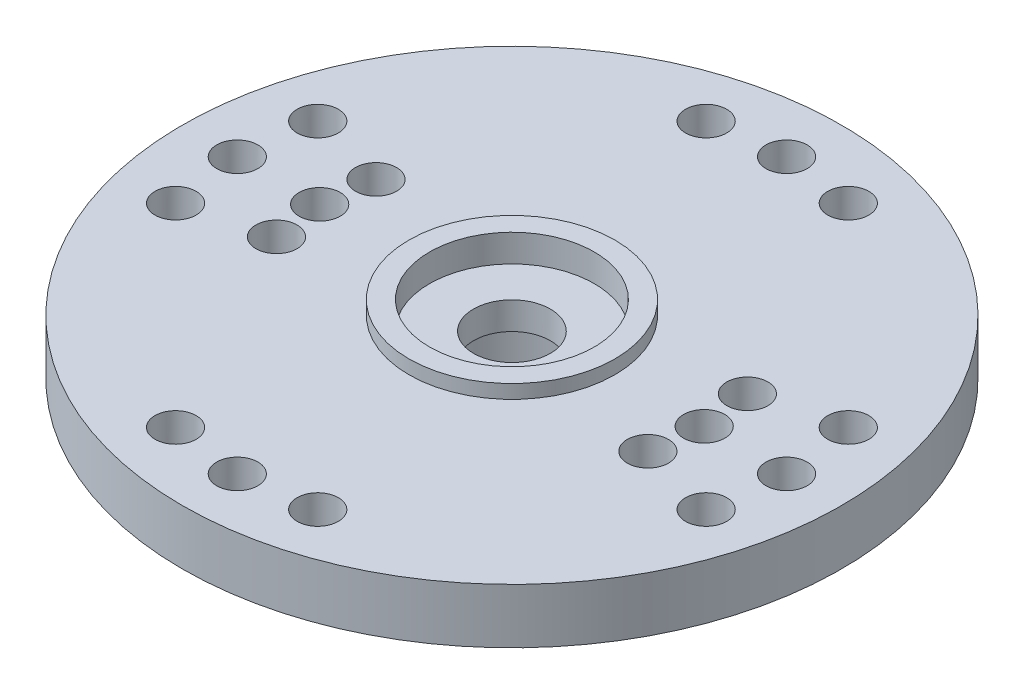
from build123d import *

# Parameters (mm, degrees)
F_1_5_1_5_DIAMETER_HOLE1_D = 1.5
CIRPATTERN1_COUNT          = 4
SKETCH4_R                  = 3
CUT_EXTRUDE1_DEPTH         = 1
CUT_EXTRUDE2_START         = -3
SKETCH5_R                  = 3
CUT_EXTRUDE2_DEPTH         = 3
F_1_5_1_5_DIAMETER_HOLE2_D = 1.5
CIRPATTERN2_COUNT          = 2


with BuildPart() as part:
    # Sketch1 → Revolve1 (revolve)
    with BuildSketch(Plane.XY, mode=Mode.PRIVATE) as revolve1_sk:
        Polygon((-12, 0), (-3.75, 0), (-3.75, 0.5), (-1.4, 0.5), (-1.4, -4.5), (-4.45, -4.5), (-4.45, -2), (-12, -2), align=None)
    revolve(revolve1_sk.sketch.rotate(Axis((0, 0, 0), (0, -1, 0)), 270), axis=Axis((0, 0, 0), (0, -1, 0)))

    # 1.5 _1.5_ Diameter Hole1 (through all)
    with Locations(Plane(origin=(0, 0, 0), x_dir=(-1, 0, 0), z_dir=(0, 1, 0))):
        with Locations((0, -10), (2.588190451, -9.659258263), (-2.588190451, -9.659258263)):
            f_1_5_1_5_diameter_hole1 = Hole(F_1_5_1_5_DIAMETER_HOLE1_D / 2)

    # CirPattern1: 1.5 _1.5_ Diameter Hole1 ×4 about axis
    cirpattern1_axis = Axis((0, 0, 0), (0, 1, 0))
    for i in range(1, CIRPATTERN1_COUNT):
        add(f_1_5_1_5_diameter_hole1.rotate(cirpattern1_axis, i * 360 / CIRPATTERN1_COUNT), mode=Mode.SUBTRACT)

    # Sketch4 → Cut-Extrude1 (cut)
    with BuildSketch(Plane(origin=(0, 0.5, 0), x_dir=(-1, 0, 0), z_dir=(0, 1, 0))):
        with Locations(Location((0, 0, 0), (0, 0, 90))):
            Circle(SKETCH4_R)
    extrude(amount=-CUT_EXTRUDE1_DEPTH, mode=Mode.SUBTRACT)

    # Sketch5 → Cut-Extrude2 (cut)
    with BuildSketch(Plane.XZ.offset(4.5).offset(CUT_EXTRUDE2_START)):
        with Locations(Location((0, 0, 0), (0, 0, 90))):
            Circle(SKETCH5_R)
    extrude(amount=CUT_EXTRUDE2_DEPTH, mode=Mode.SUBTRACT)

    # 1.5 _1.5_ Diameter Hole2 (through all)
    with Locations(Plane(origin=(0, 0, 0), x_dir=(-1, 0, 0), z_dir=(0, 1, 0))):
        with Locations((6.761480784, -1.811733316), (7, 0), (6.761480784, 1.811733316)):
            f_1_5_1_5_diameter_hole2 = Hole(F_1_5_1_5_DIAMETER_HOLE2_D / 2)

    # CirPattern2: 1.5 _1.5_ Diameter Hole2 ×2 about axis
    cirpattern2_axis = Axis((0, 0, 0), (0, 1, 0))
    for i in range(1, CIRPATTERN2_COUNT):
        add(f_1_5_1_5_diameter_hole2.rotate(cirpattern2_axis, i * 360 / CIRPATTERN2_COUNT), mode=Mode.SUBTRACT)


solid = part.part
